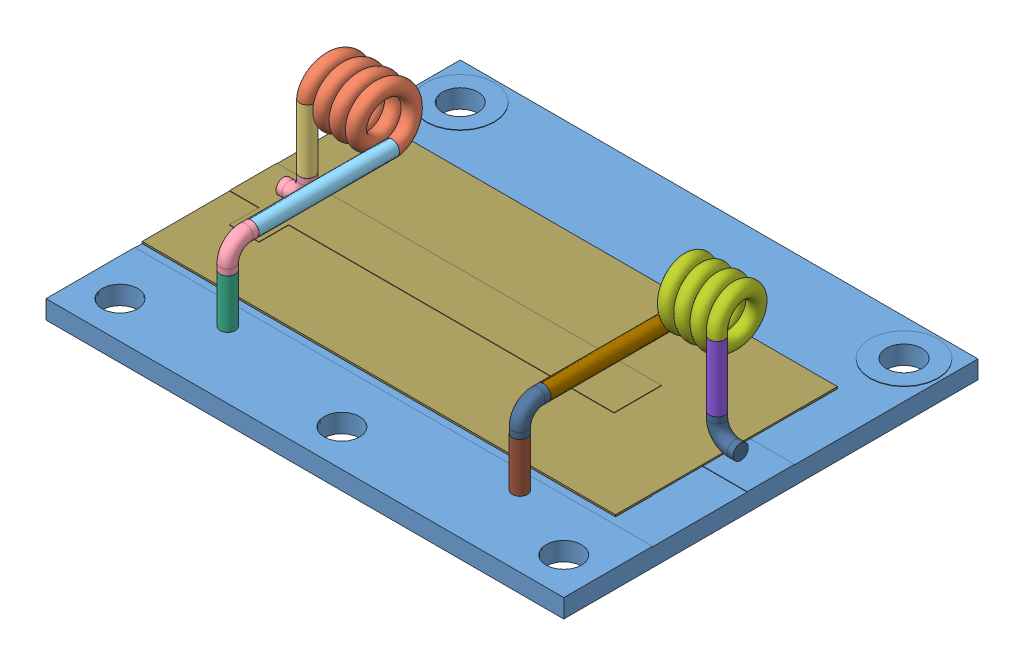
SolidWorks assembly 10-610109-100 Rev A.SLDASM, configuration Default (file format 10000). Lengths in mm.
Overall size (44.45 12.56 35.56).
16 component instances, 12 part files, 3 mates.
Components (placement in the parent):
- 12-610109-100 Rev A-1: 12-610109-100 Rev A.SLDPRT [Default] at (15.0002 26.4712 32.2167) size (44.45 1.6 35.56)
- 10-600056-100 Rev A-1: 10-600056-100 Rev A.SLDASM [Default] at (5.9928 31.3213 28.4994) x (0 0 1) z (-1 0 0) size (17.42 10.93 7.92)
  - 15-600056-100 Rev A-1: 15-600056-100 Rev A.SLDPRT [Default] at (1.6762 4.9888 3.6889) size (5.36 5.36 6.53)
  - 15-600056-102 Rev A-4: 15-600056-102 Rev A.SLDPRT [Default] at (3.7082 4.9888 8.5784) x (1 0 0) z (0 -1 0) size (1.3 1.3 5.46)
  - 15-600056-101 Rev A-3: 15-600056-101 Rev A.SLDPRT [Default] at (3.7082 -2.5042 10.6104) x (0 0 1) z (1 0 0) size (2.68 2.68 1.3)
  - 15-600056-104 Rev A-1: 15-600056-104 Rev A.SLDPRT [Default] at (1.6762 2.9568 3.3397) x (0 0 -1) z (1 0 0) size (1.3 1.3 12.06)
  - 15-600056-101 Rev A-4: 15-600056-101 Rev A.SLDPRT [Default] at (15.7732 0.9248 3.3397) x (0 -1 0) z (0 0 1) size (2.68 2.68 1.3)
  - 15-600056-105 Rev A-1: 15-600056-105 Rev A.SLDPRT [Default] at (15.7732 0.9248 3.3397) x (1 0 0) z (0 -1 0) size (1.3 1.3 4.19)
- 10-600057-100 Rev A-1: 10-600057-100 Rev A.SLDASM [Default] at (23.8397 30.3684 31.6886) x (0 0 -1) z (1 0 0) size (17.04 11.09 7.92)
  - 15-600057-100 Rev A-1: 15-600057-100 Rev A.SLDPRT [Default] at (1.5104 5.9512 4.5652) size (5.36 5.36 6.53)
  - 15-600057-102 Rev A-4: 15-600057-102 Rev A.SLDPRT [Default] at (-0.5216 5.9512 8.7562) x (1 0 0) z (0 -1 0) size (1.3 1.3 5.61)
  - 15-600057-103 Rev A-1: 15-600057-103 Rev A.SLDPRT [Default] at (-10.1736 3.9192 3.5175) x (0 0 -1) z (1 0 0) size (1.3 1.3 11.68)
  - 15-600057-101 Rev A-3: 15-600057-101 Rev A.SLDPRT [Default] at (-10.1736 3.9192 3.5175) x (1 0 0) z (0 0 1) size (2.68 2.68 1.3)
  - 15-600057-104 Rev A-1: 15-600057-104 Rev A.SLDPRT [Default] at (-12.2056 1.8872 3.5175) x (1 0 0) z (0 -1 0) size (1.3 1.3 4.34)
  - 15-600057-101 Rev A-4: 15-600057-101 Rev A.SLDPRT [Default] at (-0.5216 0.3378 8.7562) x (0 1 0) z (-1 0 0) size (2.68 2.68 1.3)
- 12-610114-100 Rev A-1: 12-610114-100 Rev A.SLDPRT [Default] at (13.0952 28.0307 32.2167) size (40.64 0.2 19.05)
Mates (geometry in assembly coordinates):
- Coincident1: coincident anti-aligned: plane of 12-610109-100 Rev A-1 through (15.0002 27.9952 32.2167) normal (0 1 0); plane of 12-610114-100 Rev A-1 through (13.0952 27.9952 32.2167) normal (0 -1 0)
- Coincident2: coincident aligned: plane of 12-610109-100 Rev A-1 through (-7.2248 27.9952 49.9967) normal (-1 0 0); plane of 12-610114-100 Rev A-1 through (-7.2248 28.1577 22.6917) normal (-1 0 0)
- Coincident3: coincident aligned: plane of 12-610109-100 Rev A-1 through (30.8752 28.0307 30.1847) normal (0 0 -1); plane of 12-610114-100 Rev A-1 through (-7.2248 28.1933 30.1847) normal (0 0 -1)
